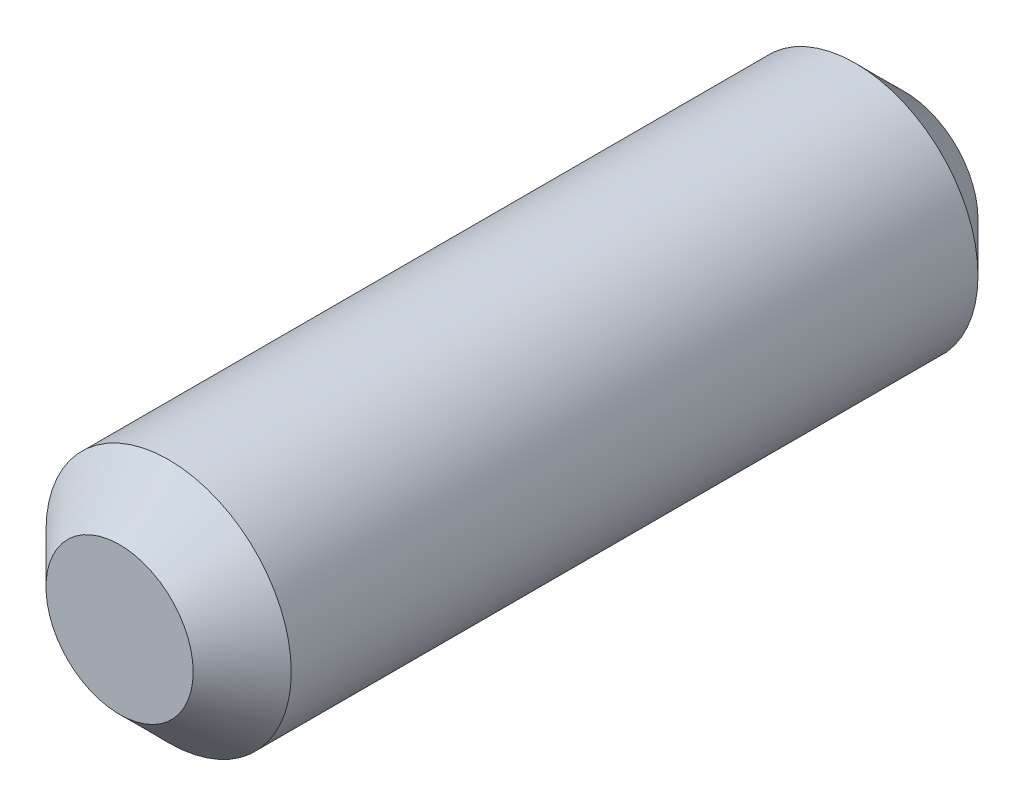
ISO-10303-21;
HEADER;
FILE_DESCRIPTION(('STEP AP214'),'2;1');
FILE_NAME('part.step','',(''),(''),'','','');
FILE_SCHEMA(('AUTOMOTIVE_DESIGN { 1 0 10303 214 1 1 1 1 }'));
ENDSEC;
DATA;
#1=APPLICATION_CONTEXT('core data for automotive mechanical design processes');
#2=APPLICATION_PROTOCOL_DEFINITION('international standard','automotive_design',2000,#1);
#3=PRODUCT_CONTEXT('',#1,'mechanical');
#4=PRODUCT('Part','Part','',(#3));
#5=PRODUCT_RELATED_PRODUCT_CATEGORY('part','',(#4));
#6=PRODUCT_DEFINITION_FORMATION('','',#4);
#7=PRODUCT_DEFINITION_CONTEXT('part definition',#1,'design');
#8=PRODUCT_DEFINITION('design','',#6,#7);
#9=PRODUCT_DEFINITION_SHAPE('','',#8);
#10=(LENGTH_UNIT() NAMED_UNIT(*) SI_UNIT(.MILLI.,.METRE.));
#11=(NAMED_UNIT(*) PLANE_ANGLE_UNIT() SI_UNIT($,.RADIAN.));
#12=(NAMED_UNIT(*) SI_UNIT($,.STERADIAN.) SOLID_ANGLE_UNIT());
#13=UNCERTAINTY_MEASURE_WITH_UNIT(LENGTH_MEASURE(1.E-05),#10,'distance_accuracy_value','');
#14=(GEOMETRIC_REPRESENTATION_CONTEXT(3) GLOBAL_UNCERTAINTY_ASSIGNED_CONTEXT((#13)) GLOBAL_UNIT_ASSIGNED_CONTEXT((#10,
#11,#12)) REPRESENTATION_CONTEXT('',''));
#15=CARTESIAN_POINT('',(0.,0.,0.));
#16=DIRECTION('',(0.,0.,1.));
#17=DIRECTION('',(1.,0.,0.));
#18=AXIS2_PLACEMENT_3D('',#15,#16,#17);
#19=CARTESIAN_POINT('',(-3.14378372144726,6.82868334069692,-8.));
#20=DIRECTION('',(0.,0.,1.));
#21=DIRECTION('',(1.,0.,0.));
#22=AXIS2_PLACEMENT_3D('',#19,#20,#21);
#23=CYLINDRICAL_SURFACE('',#22,1.25);
#24=CARTESIAN_POINT('',(-3.14378372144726,6.82868334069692,-7.5));
#25=DIRECTION('',(0.,0.,1.));
#26=DIRECTION('',(1.,0.,0.));
#27=AXIS2_PLACEMENT_3D('',#24,#25,#26);
#28=CIRCLE('',#27,1.25);
#29=CARTESIAN_POINT('',(-1.89378372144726,6.82868334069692,-7.5));
#30=VERTEX_POINT('',#29);
#31=EDGE_CURVE('E42',#30,#30,#28,.T.);
#32=ORIENTED_EDGE('',*,*,#31,.T.);
#33=EDGE_LOOP('',(#32));
#34=FACE_BOUND('',#33,.T.);
#35=CARTESIAN_POINT('',(-3.14378372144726,6.82868334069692,-0.5));
#36=DIRECTION('',(0.,0.,1.));
#37=DIRECTION('',(1.,0.,0.));
#38=AXIS2_PLACEMENT_3D('',#35,#36,#37);
#39=CIRCLE('',#38,1.25);
#40=CARTESIAN_POINT('',(-1.89378372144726,6.82868334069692,-0.5));
#41=VERTEX_POINT('',#40);
#42=EDGE_CURVE('E46',#41,#41,#39,.F.);
#43=ORIENTED_EDGE('',*,*,#42,.T.);
#44=EDGE_LOOP('',(#43));
#45=FACE_BOUND('',#44,.T.);
#46=ADVANCED_FACE('F31',(#34,#45),#23,.T.);
#47=CARTESIAN_POINT('',(-3.14378372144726,6.82868334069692,-8.));
#48=DIRECTION('',(0.,0.,1.));
#49=DIRECTION('',(1.,0.,0.));
#50=AXIS2_PLACEMENT_3D('',#47,#48,#49);
#51=PLANE('',#50);
#52=CARTESIAN_POINT('',(-3.14378372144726,6.82868334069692,-8.));
#53=DIRECTION('',(0.,0.,1.));
#54=DIRECTION('',(1.,0.,0.));
#55=AXIS2_PLACEMENT_3D('',#52,#53,#54);
#56=CIRCLE('',#55,0.749999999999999);
#57=CARTESIAN_POINT('',(-2.39378372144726,6.82868334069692,-8.));
#58=VERTEX_POINT('',#57);
#59=EDGE_CURVE('E38',#58,#58,#56,.F.);
#60=ORIENTED_EDGE('',*,*,#59,.T.);
#61=EDGE_LOOP('',(#60));
#62=FACE_BOUND('',#61,.T.);
#63=ADVANCED_FACE('F62',(#62),#51,.F.);
#64=CARTESIAN_POINT('',(-3.14378372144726,6.82868334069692,0.));
#65=DIRECTION('',(0.,0.,1.));
#66=DIRECTION('',(1.,0.,0.));
#67=AXIS2_PLACEMENT_3D('',#64,#65,#66);
#68=PLANE('',#67);
#69=CARTESIAN_POINT('',(-3.14378372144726,6.82868334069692,0.));
#70=DIRECTION('',(0.,0.,1.));
#71=DIRECTION('',(1.,0.,0.));
#72=AXIS2_PLACEMENT_3D('',#69,#70,#71);
#73=CIRCLE('',#72,0.750000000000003);
#74=CARTESIAN_POINT('',(-2.39378372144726,6.82868334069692,0.));
#75=VERTEX_POINT('',#74);
#76=EDGE_CURVE('E10',#75,#75,#73,.T.);
#77=ORIENTED_EDGE('',*,*,#76,.T.);
#78=EDGE_LOOP('',(#77));
#79=FACE_BOUND('',#78,.T.);
#80=ADVANCED_FACE('F59',(#79),#68,.T.);
#81=CARTESIAN_POINT('',(-3.14378372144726,6.82868334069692,-7.5));
#82=DIRECTION('',(0.,0.,1.));
#83=DIRECTION('',(1.,0.,0.));
#84=AXIS2_PLACEMENT_3D('',#81,#82,#83);
#85=CONICAL_SURFACE('',#84,1.25,0.78539816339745);
#86=ORIENTED_EDGE('',*,*,#59,.F.);
#87=EDGE_LOOP('',(#86));
#88=FACE_BOUND('',#87,.T.);
#89=ORIENTED_EDGE('',*,*,#31,.F.);
#90=EDGE_LOOP('',(#89));
#91=FACE_BOUND('',#90,.T.);
#92=ADVANCED_FACE('F55',(#88,#91),#85,.T.);
#93=CARTESIAN_POINT('',(-3.14378372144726,6.82868334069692,0.));
#94=DIRECTION('',(0.,0.,-1.));
#95=DIRECTION('',(-1.,0.,0.));
#96=AXIS2_PLACEMENT_3D('',#93,#94,#95);
#97=CONICAL_SURFACE('',#96,0.750000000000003,0.785398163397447);
#98=ORIENTED_EDGE('',*,*,#42,.F.);
#99=EDGE_LOOP('',(#98));
#100=FACE_BOUND('',#99,.T.);
#101=ORIENTED_EDGE('',*,*,#76,.F.);
#102=EDGE_LOOP('',(#101));
#103=FACE_BOUND('',#102,.T.);
#104=ADVANCED_FACE('F33',(#100,#103),#97,.T.);
#105=CLOSED_SHELL('',(#46,#63,#80,#92,#104));
#106=MANIFOLD_SOLID_BREP('B2',#105);
#107=ADVANCED_BREP_SHAPE_REPRESENTATION('',(#18,#106),#14);
#108=SHAPE_DEFINITION_REPRESENTATION(#9,#107);
ENDSEC;
END-ISO-10303-21;
